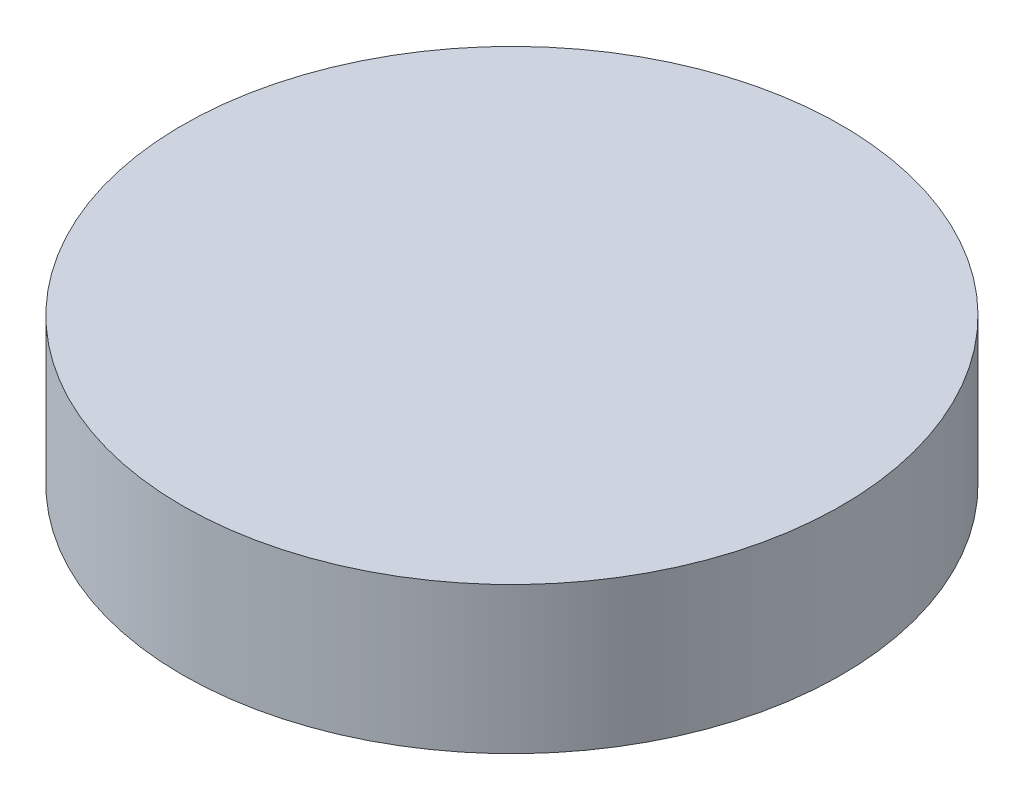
from build123d import *

# Parameters (mm, degrees)
ESQUISSE1_R        = 4.5
BOSS_EXTRU_1_DEPTH = 2


with BuildPart() as part:
    # Esquisse1 → Boss.-Extru.1 (new body)
    with BuildSketch(Plane(origin=(0, 0, 0), x_dir=(1, 0, 0), z_dir=(0, 1, 0))):
        with Locations(Location((0, 0, 0), (0, 0, 270))):
            Circle(ESQUISSE1_R)
    extrude(amount=BOSS_EXTRU_1_DEPTH)


solid = part.part
